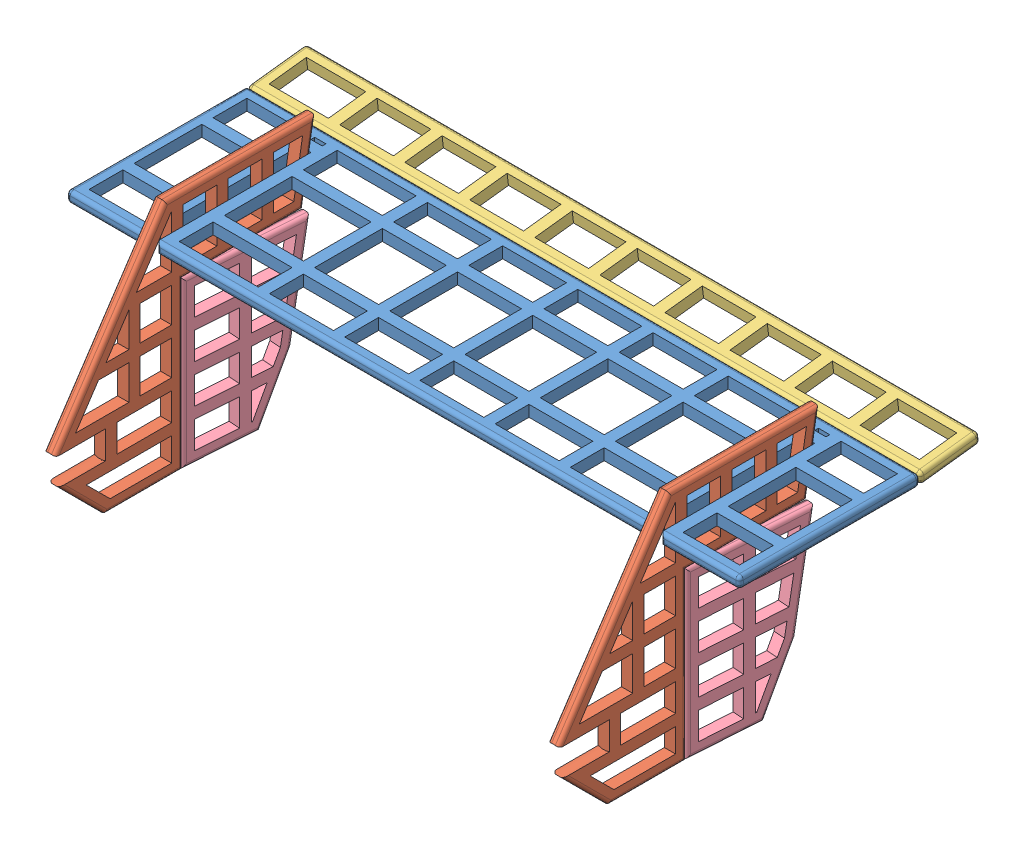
SolidWorks assembly 001-004 Aircraft Iteration 1-Subassembly 4 Tail Assembly.SLDPRT.SLDASM, configuration Default (file format 11000). Lengths in mm.
Overall size (284.16 101.67 144.78).
6 component instances, 4 part files, 13 mates.
Components (placement in the parent):
- 001-004-004 Aircraft Iteration 1-Subassembly 4-Part 4 Horizontal Stabilizer-1: 001-004-004 Aircraft Iteration 1-Subassembly 4-Part 4 Horizontal Stabilizer.SLDPRT [Default] at (-22.4847 152.7847 244.411) size (284.16 4.76 76.2)
- 001-004-003 Aircraft Iteration 1-Subassembly 4-Part 3 Vertical Stabilizer-1: 001-004-003 Aircraft Iteration 1-Subassembly 4-Part 3 Vertical Stabilizer.SLDPRT [Default] at (223.5778 68.5779 233.3092) size (5.03 101.67 110.19)
- 001-004-003 Aircraft Iteration 1-Subassembly 4-Part 3 Vertical Stabilizer-2: 001-004-003 Aircraft Iteration 1-Subassembly 4-Part 3 Vertical Stabilizer.SLDPRT [Default] at (10.8528 68.5779 233.3092) size (5.03 101.67 110.19)
- 001-004-005 Aircraft Iteration 1-Subassembly 4-Part 5 Elevator-1: 001-004-005 Aircraft Iteration 1-Subassembly 4-Part 5 Elevator.SLDPRT [Default] at (-22.4847 152.8068 167.8371) x (1 0 0) z (0 -0.117754 0.993043) size (284.16 4.76 25.4)
- 001-004-002 Aircraft Iteration 1-Subassembly 4-Part 2 Rudder-1: 001-004-002 Aircraft Iteration 1-Subassembly 4-Part 2 Rudder.SLDPRT [Default] at (223.5851 68.5779 233.0942) x (0.997704 0 0.06773) z (-0.06773 0 0.997704) size (4.76 69.85 50.8)
- 001-004-002 Aircraft Iteration 1-Subassembly 4-Part 2 Rudder-2: 001-004-002 Aircraft Iteration 1-Subassembly 4-Part 2 Rudder.SLDPRT [Default] at (10.8565 68.5779 233.2017) x (0.997704 0 0.06773) z (-0.06773 0 0.997704) size (4.76 69.85 50.8)
Mates (geometry in assembly coordinates):
- Coincident1: coincident: plane of 001-004-004 Aircraft Iteration 1-Subassembly 4-Part 4 Horizontal Stabilizer-1 through (228.3403 157.5472 174.561) normal (-1 0 0); plane of 001-004-003 Aircraft Iteration 1-Subassembly 4-Part 3 Vertical Stabilizer-1 through (228.3403 68.5779 233.3092) normal (1 0 0)
- Distance2: distance = 12.7 mm: plane of 001-004-004 Aircraft Iteration 1-Subassembly 4-Part 4 Horizontal Stabilizer-1 through (261.6778 157.5472 244.411) normal (0 1 0); plane of 001-004-003 Aircraft Iteration 1-Subassembly 4-Part 3 Vertical Stabilizer-1 through (228.3403 170.2472 240.7073) normal (0 1 0)
- Coincident5: coincident: line of 001-004-004 Aircraft Iteration 1-Subassembly 4-Part 4 Horizontal Stabilizer-1 through (223.5778 157.5472 179.3235) axis (1 0 0); plane of 001-004-003 Aircraft Iteration 1-Subassembly 4-Part 3 Vertical Stabilizer-1 through (228.3403 170.2472 177.2073) normal (0 -0.164359 -0.986401)
- Distance4: distance = 12.7 mm: plane of 001-004-003 Aircraft Iteration 1-Subassembly 4-Part 3 Vertical Stabilizer-2 through (15.6153 170.2472 240.7073) normal (0 1 0); plane of 001-004-004 Aircraft Iteration 1-Subassembly 4-Part 4 Horizontal Stabilizer-1 through (261.6778 157.5472 244.411) normal (0 1 0)
- Coincident7: coincident: plane of 001-004-004 Aircraft Iteration 1-Subassembly 4-Part 4 Horizontal Stabilizer-1 through (10.8528 157.5472 174.561) normal (1 0 0); plane of 001-004-003 Aircraft Iteration 1-Subassembly 4-Part 3 Vertical Stabilizer-2 through (10.8528 68.5779 233.3092) normal (-1 0 0)
- Coincident8: coincident: line of 001-004-004 Aircraft Iteration 1-Subassembly 4-Part 4 Horizontal Stabilizer-1 through (15.6153 157.5472 179.3235) axis (-1 0 0); plane of 001-004-003 Aircraft Iteration 1-Subassembly 4-Part 3 Vertical Stabilizer-2 through (15.6153 170.2472 177.2073) normal (0 -0.164359 -0.986401)
- Coincident9: coincident: plane of 001-004-004 Aircraft Iteration 1-Subassembly 4-Part 4 Horizontal Stabilizer-1 through (-22.4847 152.7847 244.411) normal (-1 0 0); plane of 001-004-005 Aircraft Iteration 1-Subassembly 4-Part 5 Elevator-1 through (-22.4847 152.8068 167.8371) normal (-1 0 0)
- Coincident10: coincident: line of 001-004-004 Aircraft Iteration 1-Subassembly 4-Part 4 Horizontal Stabilizer-1 through (-20.8972 155.9597 168.211) axis (1 0 0); line of 001-004-005 Aircraft Iteration 1-Subassembly 4-Part 5 Elevator-1 through (260.0903 155.9597 168.211) axis (-1 0 0)
- Coincident11: coincident: plane of 001-004-003 Aircraft Iteration 1-Subassembly 4-Part 3 Vertical Stabilizer-1 through (228.3403 68.5779 233.3092) normal (0 -1 0); plane of 001-004-002 Aircraft Iteration 1-Subassembly 4-Part 2 Rudder-1 through (230.4183 68.5779 202.7533) normal (0 -1 0)
- Coincident12: coincident: line of 001-004-003 Aircraft Iteration 1-Subassembly 4-Part 3 Vertical Stabilizer-1 through (226.7528 138.4279 233.3092) axis (0 -1 0); line of 001-004-002 Aircraft Iteration 1-Subassembly 4-Part 2 Rudder-1 through (226.7528 68.5779 233.3092) axis (0 1 0)
- Coincident14: coincident: plane of 001-004-003 Aircraft Iteration 1-Subassembly 4-Part 3 Vertical Stabilizer-2 through (15.6153 68.5779 233.3092) normal (0 -1 0); plane of 001-004-002 Aircraft Iteration 1-Subassembly 4-Part 2 Rudder-2 through (17.6897 68.5779 202.8608) normal (0 -1 0)
- Coincident15: coincident: line of 001-004-003 Aircraft Iteration 1-Subassembly 4-Part 3 Vertical Stabilizer-2 through (12.4403 68.5779 233.3092) axis (0 1 0); line of 001-004-002 Aircraft Iteration 1-Subassembly 4-Part 2 Rudder-2 through (12.4403 138.4279 233.3092) axis (0 -1 0)
- Parallel2: parallel: plane of 001-004-002 Aircraft Iteration 1-Subassembly 4-Part 2 Rudder-1 through (228.3367 68.5779 233.4167) normal (0.997704 0 0.06773); plane of 001-004-002 Aircraft Iteration 1-Subassembly 4-Part 2 Rudder-2 through (10.8565 68.5779 233.2017) normal (-0.997704 0 -0.06773)
